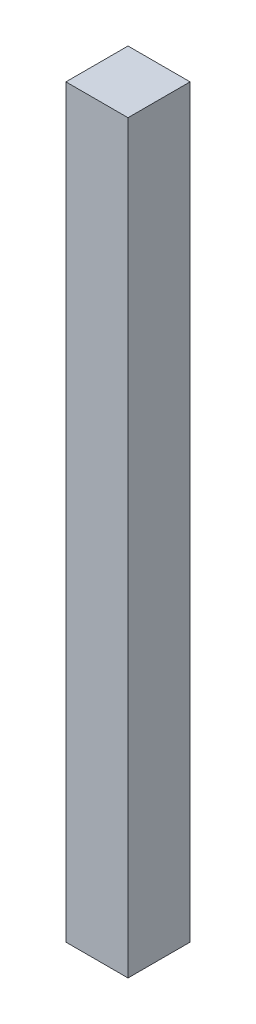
from build123d import *

# Parameters (mm, degrees)
SKETCH1_W           = 25.4
SKETCH1_H           = 25.4
BOSS_EXTRUDE1_DEPTH = 304.8


with BuildPart() as part:
    # Sketch1 → Boss-Extrude1 (new body)
    with BuildSketch(Plane(origin=(0, 0, 0), x_dir=(1, 0, 0), z_dir=(0, 1, 0))):
        with Locations((12.7, 12.7)):
            Rectangle(SKETCH1_W, SKETCH1_H)
    extrude(amount=BOSS_EXTRUDE1_DEPTH)


solid = part.part
